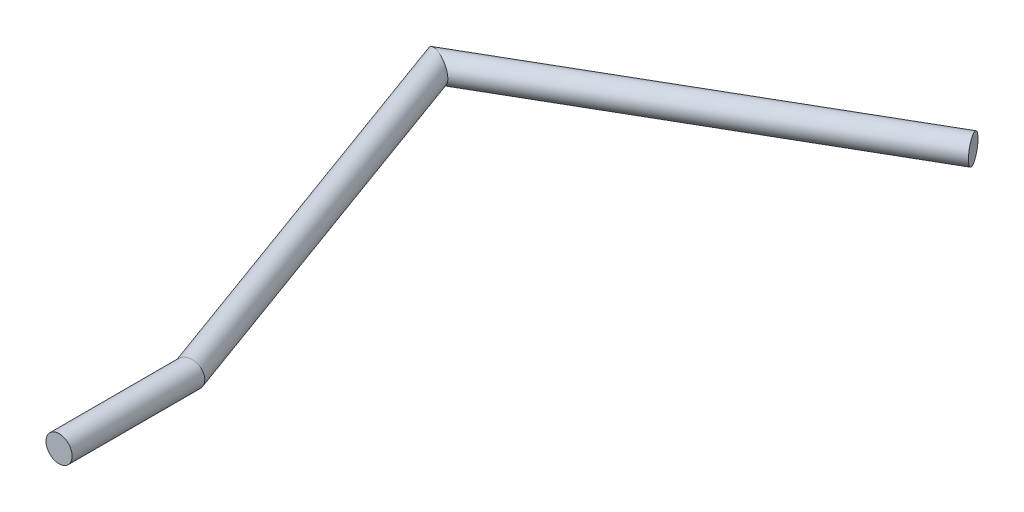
ISO-10303-21;
HEADER;
FILE_DESCRIPTION(('STEP AP214'),'2;1');
FILE_NAME('part.step','',(''),(''),'','','');
FILE_SCHEMA(('AUTOMOTIVE_DESIGN { 1 0 10303 214 1 1 1 1 }'));
ENDSEC;
DATA;
#1=APPLICATION_CONTEXT('core data for automotive mechanical design processes');
#2=APPLICATION_PROTOCOL_DEFINITION('international standard','automotive_design',2000,#1);
#3=PRODUCT_CONTEXT('',#1,'mechanical');
#4=PRODUCT('Part','Part','',(#3));
#5=PRODUCT_RELATED_PRODUCT_CATEGORY('part','',(#4));
#6=PRODUCT_DEFINITION_FORMATION('','',#4);
#7=PRODUCT_DEFINITION_CONTEXT('part definition',#1,'design');
#8=PRODUCT_DEFINITION('design','',#6,#7);
#9=PRODUCT_DEFINITION_SHAPE('','',#8);
#10=(LENGTH_UNIT() NAMED_UNIT(*) SI_UNIT(.MILLI.,.METRE.));
#11=(NAMED_UNIT(*) PLANE_ANGLE_UNIT() SI_UNIT($,.RADIAN.));
#12=(NAMED_UNIT(*) SI_UNIT($,.STERADIAN.) SOLID_ANGLE_UNIT());
#13=UNCERTAINTY_MEASURE_WITH_UNIT(LENGTH_MEASURE(1.E-05),#10,'distance_accuracy_value','');
#14=(GEOMETRIC_REPRESENTATION_CONTEXT(3) GLOBAL_UNCERTAINTY_ASSIGNED_CONTEXT((#13)) GLOBAL_UNIT_ASSIGNED_CONTEXT((#10,
#11,#12)) REPRESENTATION_CONTEXT('',''));
#15=CARTESIAN_POINT('',(0.,0.,0.));
#16=DIRECTION('',(0.,0.,1.));
#17=DIRECTION('',(1.,0.,0.));
#18=AXIS2_PLACEMENT_3D('',#15,#16,#17);
#19=CARTESIAN_POINT('',(-54.3412045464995,0.,-199.185686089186));
#20=DIRECTION('',(0.86602540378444,0.,-0.499999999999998));
#21=DIRECTION('',(-0.499999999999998,0.,-0.86602540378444));
#22=AXIS2_PLACEMENT_3D('',#19,#20,#21);
#23=CYLINDRICAL_SURFACE('',#22,5.);
#24=CARTESIAN_POINT('',(-54.3412045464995,0.,-199.185686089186));
#25=DIRECTION('',(0.342020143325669,0.,-0.939692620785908));
#26=DIRECTION('',(-0.939692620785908,0.,-0.342020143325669));
#27=AXIS2_PLACEMENT_3D('',#24,#25,#26);
#28=ELLIPSE('',#27,6.5270364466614,5.);
#29=CARTESIAN_POINT('',(-60.4746125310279,0.,-201.418064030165));
#30=VERTEX_POINT('',#29);
#31=EDGE_CURVE('E43',#30,#30,#28,.T.);
#32=ORIENTED_EDGE('',*,*,#31,.T.);
#33=EDGE_LOOP('',(#32));
#34=FACE_BOUND('',#33,.T.);
#35=CARTESIAN_POINT('',(75.5626060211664,0.,-274.185686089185));
#36=DIRECTION('',(0.86602540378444,0.,-0.499999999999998));
#37=DIRECTION('',(-0.499999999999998,0.,-0.86602540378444));
#38=AXIS2_PLACEMENT_3D('',#35,#36,#37);
#39=CIRCLE('',#38,5.);
#40=CARTESIAN_POINT('',(73.0626060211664,0.,-278.515813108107));
#41=VERTEX_POINT('',#40);
#42=EDGE_CURVE('E11',#41,#41,#39,.F.);
#43=ORIENTED_EDGE('',*,*,#42,.T.);
#44=EDGE_LOOP('',(#43));
#45=FACE_BOUND('',#44,.T.);
#46=ADVANCED_FACE('F36',(#34,#45),#23,.T.);
#47=CARTESIAN_POINT('',(0.,0.,-49.8844536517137));
#48=DIRECTION('',(-0.342020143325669,0.,-0.939692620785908));
#49=DIRECTION('',(-0.939692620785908,0.,0.342020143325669));
#50=AXIS2_PLACEMENT_3D('',#47,#48,#49);
#51=CYLINDRICAL_SURFACE('',#50,5.);
#52=CARTESIAN_POINT('',(0.,0.,-49.8844536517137));
#53=DIRECTION('',(-0.173648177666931,0.,-0.984807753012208));
#54=DIRECTION('',(-0.984807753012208,0.,0.173648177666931));
#55=AXIS2_PLACEMENT_3D('',#52,#53,#54);
#56=ELLIPSE('',#55,5.07713305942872,5.);
#57=CARTESIAN_POINT('',(-5.,0.,-49.0028187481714));
#58=VERTEX_POINT('',#57);
#59=EDGE_CURVE('E49',#58,#58,#56,.F.);
#60=ORIENTED_EDGE('',*,*,#59,.F.);
#61=EDGE_LOOP('',(#60));
#62=FACE_BOUND('',#61,.T.);
#63=ORIENTED_EDGE('',*,*,#31,.F.);
#64=EDGE_LOOP('',(#63));
#65=FACE_BOUND('',#64,.T.);
#66=ADVANCED_FACE('F69',(#62,#65),#51,.T.);
#67=CARTESIAN_POINT('',(0.,0.,0.));
#68=DIRECTION('',(0.,0.,1.));
#69=DIRECTION('',(1.,0.,0.));
#70=AXIS2_PLACEMENT_3D('',#67,#68,#69);
#71=PLANE('',#70);
#72=CARTESIAN_POINT('',(0.,0.,0.));
#73=DIRECTION('',(0.,0.,1.));
#74=DIRECTION('',(1.,0.,0.));
#75=AXIS2_PLACEMENT_3D('',#72,#73,#74);
#76=CIRCLE('',#75,5.);
#77=CARTESIAN_POINT('',(5.,0.,0.));
#78=VERTEX_POINT('',#77);
#79=EDGE_CURVE('E53',#78,#78,#76,.T.);
#80=ORIENTED_EDGE('',*,*,#79,.T.);
#81=EDGE_LOOP('',(#80));
#82=FACE_BOUND('',#81,.T.);
#83=ADVANCED_FACE('F60',(#82),#71,.T.);
#84=CARTESIAN_POINT('',(0.,0.,-64.0265892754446));
#85=DIRECTION('',(0.,0.,1.));
#86=DIRECTION('',(1.,0.,0.));
#87=AXIS2_PLACEMENT_3D('',#84,#85,#86);
#88=CYLINDRICAL_SURFACE('',#87,5.);
#89=ORIENTED_EDGE('',*,*,#79,.F.);
#90=EDGE_LOOP('',(#89));
#91=FACE_BOUND('',#90,.T.);
#92=ORIENTED_EDGE('',*,*,#59,.T.);
#93=EDGE_LOOP('',(#92));
#94=FACE_BOUND('',#93,.T.);
#95=ADVANCED_FACE('F62',(#91,#94),#88,.T.);
#96=CARTESIAN_POINT('',(75.5626060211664,0.,-274.185686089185));
#97=DIRECTION('',(0.86602540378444,0.,-0.499999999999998));
#98=DIRECTION('',(-0.499999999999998,0.,-0.86602540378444));
#99=AXIS2_PLACEMENT_3D('',#96,#97,#98);
#100=PLANE('',#99);
#101=ORIENTED_EDGE('',*,*,#42,.F.);
#102=EDGE_LOOP('',(#101));
#103=FACE_BOUND('',#102,.T.);
#104=ADVANCED_FACE('F65',(#103),#100,.T.);
#105=CLOSED_SHELL('',(#46,#66,#83,#95,#104));
#106=MANIFOLD_SOLID_BREP('B2',#105);
#107=ADVANCED_BREP_SHAPE_REPRESENTATION('',(#18,#106),#14);
#108=SHAPE_DEFINITION_REPRESENTATION(#9,#107);
ENDSEC;
END-ISO-10303-21;
